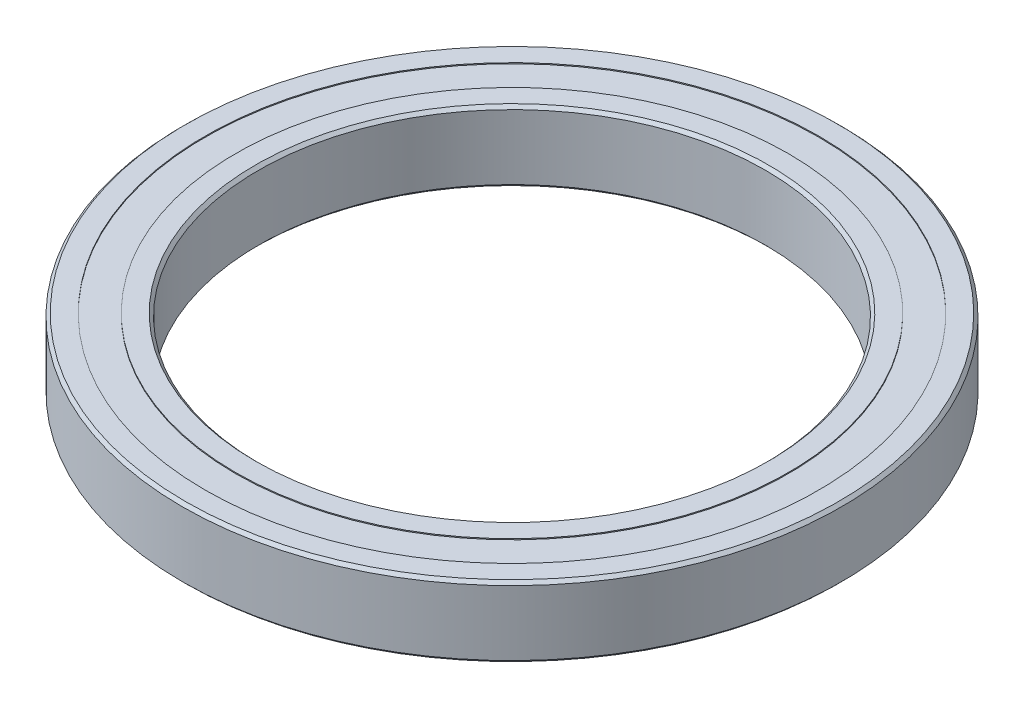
ISO-10303-21;
HEADER;
FILE_DESCRIPTION(('STEP AP214'),'2;1');
FILE_NAME('part.step','',(''),(''),'','','');
FILE_SCHEMA(('AUTOMOTIVE_DESIGN { 1 0 10303 214 1 1 1 1 }'));
ENDSEC;
DATA;
#1=APPLICATION_CONTEXT('core data for automotive mechanical design processes');
#2=APPLICATION_PROTOCOL_DEFINITION('international standard','automotive_design',2000,#1);
#3=PRODUCT_CONTEXT('',#1,'mechanical');
#4=PRODUCT('Part','Part','',(#3));
#5=PRODUCT_RELATED_PRODUCT_CATEGORY('part','',(#4));
#6=PRODUCT_DEFINITION_FORMATION('','',#4);
#7=PRODUCT_DEFINITION_CONTEXT('part definition',#1,'design');
#8=PRODUCT_DEFINITION('design','',#6,#7);
#9=PRODUCT_DEFINITION_SHAPE('','',#8);
#10=(LENGTH_UNIT() NAMED_UNIT(*) SI_UNIT(.MILLI.,.METRE.));
#11=(NAMED_UNIT(*) PLANE_ANGLE_UNIT() SI_UNIT($,.RADIAN.));
#12=(NAMED_UNIT(*) SI_UNIT($,.STERADIAN.) SOLID_ANGLE_UNIT());
#13=UNCERTAINTY_MEASURE_WITH_UNIT(LENGTH_MEASURE(1.E-05),#10,'distance_accuracy_value','');
#14=(GEOMETRIC_REPRESENTATION_CONTEXT(3) GLOBAL_UNCERTAINTY_ASSIGNED_CONTEXT((#13)) GLOBAL_UNIT_ASSIGNED_CONTEXT((#10,
#11,#12)) REPRESENTATION_CONTEXT('',''));
#15=CARTESIAN_POINT('',(0.,0.,0.));
#16=DIRECTION('',(0.,0.,1.));
#17=DIRECTION('',(1.,0.,0.));
#18=AXIS2_PLACEMENT_3D('',#15,#16,#17);
#19=CARTESIAN_POINT('',(0.,0.,0.));
#20=DIRECTION('',(0.,1.,0.));
#21=DIRECTION('',(0.,0.,1.));
#22=AXIS2_PLACEMENT_3D('',#19,#20,#21);
#23=PLANE('',#22);
#24=CARTESIAN_POINT('',(0.,0.,0.));
#25=DIRECTION('',(0.,1.,0.));
#26=DIRECTION('',(0.,0.,1.));
#27=AXIS2_PLACEMENT_3D('',#24,#25,#26);
#28=CIRCLE('',#27,25.3);
#29=CARTESIAN_POINT('',(0.,0.,25.3));
#30=VERTEX_POINT('',#29);
#31=EDGE_CURVE('E84',#30,#30,#28,.T.);
#32=ORIENTED_EDGE('',*,*,#31,.T.);
#33=EDGE_LOOP('',(#32));
#34=FACE_BOUND('',#33,.T.);
#35=CARTESIAN_POINT('',(0.,0.,0.));
#36=DIRECTION('',(0.,-1.,0.));
#37=DIRECTION('',(0.,0.,-1.));
#38=AXIS2_PLACEMENT_3D('',#35,#36,#37);
#39=CIRCLE('',#38,27.25);
#40=CARTESIAN_POINT('',(0.,0.,-27.25));
#41=VERTEX_POINT('',#40);
#42=EDGE_CURVE('E117',#41,#41,#39,.T.);
#43=ORIENTED_EDGE('',*,*,#42,.T.);
#44=EDGE_LOOP('',(#43));
#45=FACE_BOUND('',#44,.T.);
#46=ADVANCED_FACE('F51',(#34,#45),#23,.F.);
#47=CARTESIAN_POINT('',(0.,7.,0.));
#48=DIRECTION('',(0.,1.,0.));
#49=DIRECTION('',(0.,0.,1.));
#50=AXIS2_PLACEMENT_3D('',#47,#48,#49);
#51=PLANE('',#50);
#52=CARTESIAN_POINT('',(0.,7.,0.));
#53=DIRECTION('',(0.,1.,0.));
#54=DIRECTION('',(0.,0.,1.));
#55=AXIS2_PLACEMENT_3D('',#52,#53,#54);
#56=CIRCLE('',#55,25.3);
#57=CARTESIAN_POINT('',(0.,7.,25.3));
#58=VERTEX_POINT('',#57);
#59=EDGE_CURVE('E10',#58,#58,#56,.F.);
#60=ORIENTED_EDGE('',*,*,#59,.T.);
#61=EDGE_LOOP('',(#60));
#62=FACE_BOUND('',#61,.T.);
#63=CARTESIAN_POINT('',(0.,7.,0.));
#64=DIRECTION('',(0.,1.,0.));
#65=DIRECTION('',(0.,0.,1.));
#66=AXIS2_PLACEMENT_3D('',#63,#64,#65);
#67=CIRCLE('',#66,27.25);
#68=CARTESIAN_POINT('',(0.,7.,27.25));
#69=VERTEX_POINT('',#68);
#70=EDGE_CURVE('E101',#69,#69,#67,.T.);
#71=ORIENTED_EDGE('',*,*,#70,.T.);
#72=EDGE_LOOP('',(#71));
#73=FACE_BOUND('',#72,.T.);
#74=ADVANCED_FACE('F176',(#62,#73),#51,.T.);
#75=CARTESIAN_POINT('',(0.,7.,0.));
#76=DIRECTION('',(0.,1.,0.));
#77=DIRECTION('',(0.,0.,1.));
#78=AXIS2_PLACEMENT_3D('',#75,#76,#77);
#79=CIRCLE('',#78,30.25);
#80=CARTESIAN_POINT('',(0.,7.,30.25));
#81=VERTEX_POINT('',#80);
#82=EDGE_CURVE('E93',#81,#81,#79,.T.);
#83=ORIENTED_EDGE('',*,*,#82,.F.);
#84=EDGE_LOOP('',(#83));
#85=FACE_BOUND('',#84,.T.);
#86=CARTESIAN_POINT('',(0.,7.,0.));
#87=DIRECTION('',(0.,1.,0.));
#88=DIRECTION('',(0.,0.,1.));
#89=AXIS2_PLACEMENT_3D('',#86,#87,#88);
#90=CIRCLE('',#89,32.2);
#91=CARTESIAN_POINT('',(0.,7.,32.2));
#92=VERTEX_POINT('',#91);
#93=EDGE_CURVE('E60',#92,#92,#90,.T.);
#94=ORIENTED_EDGE('',*,*,#93,.T.);
#95=EDGE_LOOP('',(#94));
#96=FACE_BOUND('',#95,.T.);
#97=ADVANCED_FACE('F145',(#85,#96),#51,.T.);
#98=CARTESIAN_POINT('',(0.,0.,0.));
#99=DIRECTION('',(0.,-1.,0.));
#100=DIRECTION('',(0.,0.,-1.));
#101=AXIS2_PLACEMENT_3D('',#98,#99,#100);
#102=CIRCLE('',#101,30.25);
#103=CARTESIAN_POINT('',(0.,0.,-30.25));
#104=VERTEX_POINT('',#103);
#105=EDGE_CURVE('E109',#104,#104,#102,.T.);
#106=ORIENTED_EDGE('',*,*,#105,.F.);
#107=EDGE_LOOP('',(#106));
#108=FACE_BOUND('',#107,.T.);
#109=CARTESIAN_POINT('',(0.,0.,0.));
#110=DIRECTION('',(0.,1.,0.));
#111=DIRECTION('',(0.,0.,1.));
#112=AXIS2_PLACEMENT_3D('',#109,#110,#111);
#113=CIRCLE('',#112,32.2);
#114=CARTESIAN_POINT('',(0.,0.,32.2));
#115=VERTEX_POINT('',#114);
#116=EDGE_CURVE('E88',#115,#115,#113,.F.);
#117=ORIENTED_EDGE('',*,*,#116,.T.);
#118=EDGE_LOOP('',(#117));
#119=FACE_BOUND('',#118,.T.);
#120=ADVANCED_FACE('F141',(#108,#119),#23,.F.);
#121=CARTESIAN_POINT('',(0.,7.,0.));
#122=DIRECTION('',(0.,-1.,0.));
#123=DIRECTION('',(0.,0.,-1.));
#124=AXIS2_PLACEMENT_3D('',#121,#122,#123);
#125=CYLINDRICAL_SURFACE('',#124,32.5);
#126=CARTESIAN_POINT('',(0.,0.300000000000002,0.));
#127=DIRECTION('',(0.,1.,0.));
#128=DIRECTION('',(0.,0.,1.));
#129=AXIS2_PLACEMENT_3D('',#126,#127,#128);
#130=CIRCLE('',#129,32.5);
#131=CARTESIAN_POINT('',(0.,0.300000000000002,32.5));
#132=VERTEX_POINT('',#131);
#133=EDGE_CURVE('E65',#132,#132,#130,.T.);
#134=ORIENTED_EDGE('',*,*,#133,.T.);
#135=EDGE_LOOP('',(#134));
#136=FACE_BOUND('',#135,.T.);
#137=CARTESIAN_POINT('',(0.,6.69999999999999,0.));
#138=DIRECTION('',(0.,1.,0.));
#139=DIRECTION('',(0.,0.,1.));
#140=AXIS2_PLACEMENT_3D('',#137,#138,#139);
#141=CIRCLE('',#140,32.5);
#142=CARTESIAN_POINT('',(0.,6.69999999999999,32.5));
#143=VERTEX_POINT('',#142);
#144=EDGE_CURVE('E70',#143,#143,#141,.F.);
#145=ORIENTED_EDGE('',*,*,#144,.T.);
#146=EDGE_LOOP('',(#145));
#147=FACE_BOUND('',#146,.T.);
#148=ADVANCED_FACE('F144',(#136,#147),#125,.T.);
#149=CARTESIAN_POINT('',(0.,7.,0.));
#150=DIRECTION('',(0.,-1.,0.));
#151=DIRECTION('',(0.,0.,-1.));
#152=AXIS2_PLACEMENT_3D('',#149,#150,#151);
#153=CYLINDRICAL_SURFACE('',#152,25.);
#154=CARTESIAN_POINT('',(0.,0.299999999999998,0.));
#155=DIRECTION('',(0.,1.,0.));
#156=DIRECTION('',(0.,0.,1.));
#157=AXIS2_PLACEMENT_3D('',#154,#155,#156);
#158=CIRCLE('',#157,25.);
#159=CARTESIAN_POINT('',(0.,0.299999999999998,25.));
#160=VERTEX_POINT('',#159);
#161=EDGE_CURVE('E76',#160,#160,#158,.F.);
#162=ORIENTED_EDGE('',*,*,#161,.T.);
#163=EDGE_LOOP('',(#162));
#164=FACE_BOUND('',#163,.T.);
#165=CARTESIAN_POINT('',(0.,6.7,0.));
#166=DIRECTION('',(0.,1.,0.));
#167=DIRECTION('',(0.,0.,1.));
#168=AXIS2_PLACEMENT_3D('',#165,#166,#167);
#169=CIRCLE('',#168,25.);
#170=CARTESIAN_POINT('',(0.,6.7,25.));
#171=VERTEX_POINT('',#170);
#172=EDGE_CURVE('E80',#171,#171,#169,.T.);
#173=ORIENTED_EDGE('',*,*,#172,.T.);
#174=EDGE_LOOP('',(#173));
#175=FACE_BOUND('',#174,.T.);
#176=ADVANCED_FACE('F159',(#164,#175),#153,.F.);
#177=CARTESIAN_POINT('',(0.,0.,0.));
#178=DIRECTION('',(0.,-1.,0.));
#179=DIRECTION('',(0.,0.,-1.));
#180=AXIS2_PLACEMENT_3D('',#177,#178,#179);
#181=CONICAL_SURFACE('',#180,25.3,0.785398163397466);
#182=ORIENTED_EDGE('',*,*,#161,.F.);
#183=EDGE_LOOP('',(#182));
#184=FACE_BOUND('',#183,.T.);
#185=ORIENTED_EDGE('',*,*,#31,.F.);
#186=EDGE_LOOP('',(#185));
#187=FACE_BOUND('',#186,.T.);
#188=ADVANCED_FACE('F153',(#184,#187),#181,.F.);
#189=CARTESIAN_POINT('',(0.,0.300000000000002,0.));
#190=DIRECTION('',(0.,1.,0.));
#191=DIRECTION('',(0.,0.,1.));
#192=AXIS2_PLACEMENT_3D('',#189,#190,#191);
#193=CONICAL_SURFACE('',#192,32.5,0.785398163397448);
#194=ORIENTED_EDGE('',*,*,#116,.F.);
#195=EDGE_LOOP('',(#194));
#196=FACE_BOUND('',#195,.T.);
#197=ORIENTED_EDGE('',*,*,#133,.F.);
#198=EDGE_LOOP('',(#197));
#199=FACE_BOUND('',#198,.T.);
#200=ADVANCED_FACE('F149',(#196,#199),#193,.T.);
#201=CARTESIAN_POINT('',(0.,6.7,0.));
#202=DIRECTION('',(0.,1.,0.));
#203=DIRECTION('',(0.,0.,1.));
#204=AXIS2_PLACEMENT_3D('',#201,#202,#203);
#205=CONICAL_SURFACE('',#204,25.,0.785398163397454);
#206=ORIENTED_EDGE('',*,*,#59,.F.);
#207=EDGE_LOOP('',(#206));
#208=FACE_BOUND('',#207,.T.);
#209=ORIENTED_EDGE('',*,*,#172,.F.);
#210=EDGE_LOOP('',(#209));
#211=FACE_BOUND('',#210,.T.);
#212=ADVANCED_FACE('F152',(#208,#211),#205,.F.);
#213=CARTESIAN_POINT('',(0.,7.,0.));
#214=DIRECTION('',(0.,-1.,0.));
#215=DIRECTION('',(0.,0.,-1.));
#216=AXIS2_PLACEMENT_3D('',#213,#214,#215);
#217=CONICAL_SURFACE('',#216,32.2,0.785398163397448);
#218=ORIENTED_EDGE('',*,*,#144,.F.);
#219=EDGE_LOOP('',(#218));
#220=FACE_BOUND('',#219,.T.);
#221=ORIENTED_EDGE('',*,*,#93,.F.);
#222=EDGE_LOOP('',(#221));
#223=FACE_BOUND('',#222,.T.);
#224=ADVANCED_FACE('F54',(#220,#223),#217,.T.);
#225=CARTESIAN_POINT('',(0.,6.9,0.));
#226=DIRECTION('',(0.,1.,0.));
#227=DIRECTION('',(0.,0.,1.));
#228=AXIS2_PLACEMENT_3D('',#225,#226,#227);
#229=CYLINDRICAL_SURFACE('',#228,30.25);
#230=CARTESIAN_POINT('',(0.,6.9,0.));
#231=DIRECTION('',(0.,1.,0.));
#232=DIRECTION('',(0.,0.,1.));
#233=AXIS2_PLACEMENT_3D('',#230,#231,#232);
#234=CIRCLE('',#233,30.25);
#235=CARTESIAN_POINT('',(0.,6.9,30.25));
#236=VERTEX_POINT('',#235);
#237=EDGE_CURVE('E92',#236,#236,#234,.T.);
#238=ORIENTED_EDGE('',*,*,#237,.F.);
#239=EDGE_LOOP('',(#238));
#240=FACE_BOUND('',#239,.T.);
#241=ORIENTED_EDGE('',*,*,#82,.T.);
#242=EDGE_LOOP('',(#241));
#243=FACE_BOUND('',#242,.T.);
#244=ADVANCED_FACE('F165',(#240,#243),#229,.F.);
#245=CARTESIAN_POINT('',(0.,6.9,0.));
#246=DIRECTION('',(0.,1.,0.));
#247=DIRECTION('',(0.,0.,1.));
#248=AXIS2_PLACEMENT_3D('',#245,#246,#247);
#249=PLANE('',#248);
#250=CARTESIAN_POINT('',(0.,6.9,0.));
#251=DIRECTION('',(0.,1.,0.));
#252=DIRECTION('',(0.,0.,1.));
#253=AXIS2_PLACEMENT_3D('',#250,#251,#252);
#254=CIRCLE('',#253,27.25);
#255=CARTESIAN_POINT('',(0.,6.9,27.25));
#256=VERTEX_POINT('',#255);
#257=EDGE_CURVE('E97',#256,#256,#254,.T.);
#258=ORIENTED_EDGE('',*,*,#257,.F.);
#259=EDGE_LOOP('',(#258));
#260=FACE_BOUND('',#259,.T.);
#261=ORIENTED_EDGE('',*,*,#237,.T.);
#262=EDGE_LOOP('',(#261));
#263=FACE_BOUND('',#262,.T.);
#264=ADVANCED_FACE('F171',(#260,#263),#249,.T.);
#265=CARTESIAN_POINT('',(0.,6.9,0.));
#266=DIRECTION('',(0.,1.,0.));
#267=DIRECTION('',(0.,0.,1.));
#268=AXIS2_PLACEMENT_3D('',#265,#266,#267);
#269=CYLINDRICAL_SURFACE('',#268,27.25);
#270=ORIENTED_EDGE('',*,*,#257,.T.);
#271=EDGE_LOOP('',(#270));
#272=FACE_BOUND('',#271,.T.);
#273=ORIENTED_EDGE('',*,*,#70,.F.);
#274=EDGE_LOOP('',(#273));
#275=FACE_BOUND('',#274,.T.);
#276=ADVANCED_FACE('F137',(#272,#275),#269,.T.);
#277=CARTESIAN_POINT('',(0.,0.1,0.));
#278=DIRECTION('',(0.,-1.,0.));
#279=DIRECTION('',(0.,0.,-1.));
#280=AXIS2_PLACEMENT_3D('',#277,#278,#279);
#281=CYLINDRICAL_SURFACE('',#280,30.25);
#282=CARTESIAN_POINT('',(0.,0.1,0.));
#283=DIRECTION('',(0.,-1.,0.));
#284=DIRECTION('',(0.,0.,-1.));
#285=AXIS2_PLACEMENT_3D('',#282,#283,#284);
#286=CIRCLE('',#285,30.25);
#287=CARTESIAN_POINT('',(0.,0.1,-30.25));
#288=VERTEX_POINT('',#287);
#289=EDGE_CURVE('E105',#288,#288,#286,.T.);
#290=ORIENTED_EDGE('',*,*,#289,.F.);
#291=EDGE_LOOP('',(#290));
#292=FACE_BOUND('',#291,.T.);
#293=ORIENTED_EDGE('',*,*,#105,.T.);
#294=EDGE_LOOP('',(#293));
#295=FACE_BOUND('',#294,.T.);
#296=ADVANCED_FACE('F131',(#292,#295),#281,.F.);
#297=CARTESIAN_POINT('',(0.,0.1,0.));
#298=DIRECTION('',(0.,-1.,0.));
#299=DIRECTION('',(0.,0.,-1.));
#300=AXIS2_PLACEMENT_3D('',#297,#298,#299);
#301=PLANE('',#300);
#302=CARTESIAN_POINT('',(0.,0.1,0.));
#303=DIRECTION('',(0.,-1.,0.));
#304=DIRECTION('',(0.,0.,-1.));
#305=AXIS2_PLACEMENT_3D('',#302,#303,#304);
#306=CIRCLE('',#305,27.25);
#307=CARTESIAN_POINT('',(0.,0.1,-27.25));
#308=VERTEX_POINT('',#307);
#309=EDGE_CURVE('E113',#308,#308,#306,.T.);
#310=ORIENTED_EDGE('',*,*,#309,.F.);
#311=EDGE_LOOP('',(#310));
#312=FACE_BOUND('',#311,.T.);
#313=ORIENTED_EDGE('',*,*,#289,.T.);
#314=EDGE_LOOP('',(#313));
#315=FACE_BOUND('',#314,.T.);
#316=ADVANCED_FACE('F128',(#312,#315),#301,.T.);
#317=CARTESIAN_POINT('',(0.,0.1,0.));
#318=DIRECTION('',(0.,-1.,0.));
#319=DIRECTION('',(0.,0.,-1.));
#320=AXIS2_PLACEMENT_3D('',#317,#318,#319);
#321=CYLINDRICAL_SURFACE('',#320,27.25);
#322=ORIENTED_EDGE('',*,*,#309,.T.);
#323=EDGE_LOOP('',(#322));
#324=FACE_BOUND('',#323,.T.);
#325=ORIENTED_EDGE('',*,*,#42,.F.);
#326=EDGE_LOOP('',(#325));
#327=FACE_BOUND('',#326,.T.);
#328=ADVANCED_FACE('F125',(#324,#327),#321,.T.);
#329=CLOSED_SHELL('',(#46,#74,#97,#120,#148,#176,#188,#200,#212,#224,#244,#264,#276,#296,#316,#328));
#330=MANIFOLD_SOLID_BREP('B2',#329);
#331=ADVANCED_BREP_SHAPE_REPRESENTATION('',(#18,#330),#14);
#332=SHAPE_DEFINITION_REPRESENTATION(#9,#331);
ENDSEC;
END-ISO-10303-21;
